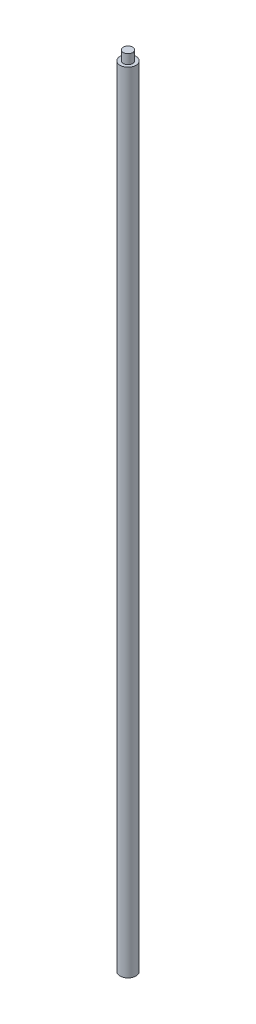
from build123d import *

# Parameters (mm, degrees)
SKETCH1_R      = 2.5
EXTRUDE1_DEPTH = 250
SKETCH2_R      = 1.5
EXTRUDE2_DEPTH = 3


with BuildPart() as part:
    # Sketch1 → Extrude1 (new body)
    with BuildSketch(Plane(origin=(0, 0, 0), x_dir=(1, 0, 0), z_dir=(0, 1, 0))):
        with Locations(Location((0, 0, 0), (0, 0, 270))):
            Circle(SKETCH1_R)
    extrude(amount=EXTRUDE1_DEPTH)

    # Sketch2 → Extrude2 (add)
    with BuildSketch(Plane(origin=(0, 250, 0), x_dir=(-1, 0, 0), z_dir=(0, 1, 0))):
        with Locations(Location((0, 0, 0), (0, 0, 90))):
            Circle(SKETCH2_R)
    extrude(amount=EXTRUDE2_DEPTH)


solid = part.part
